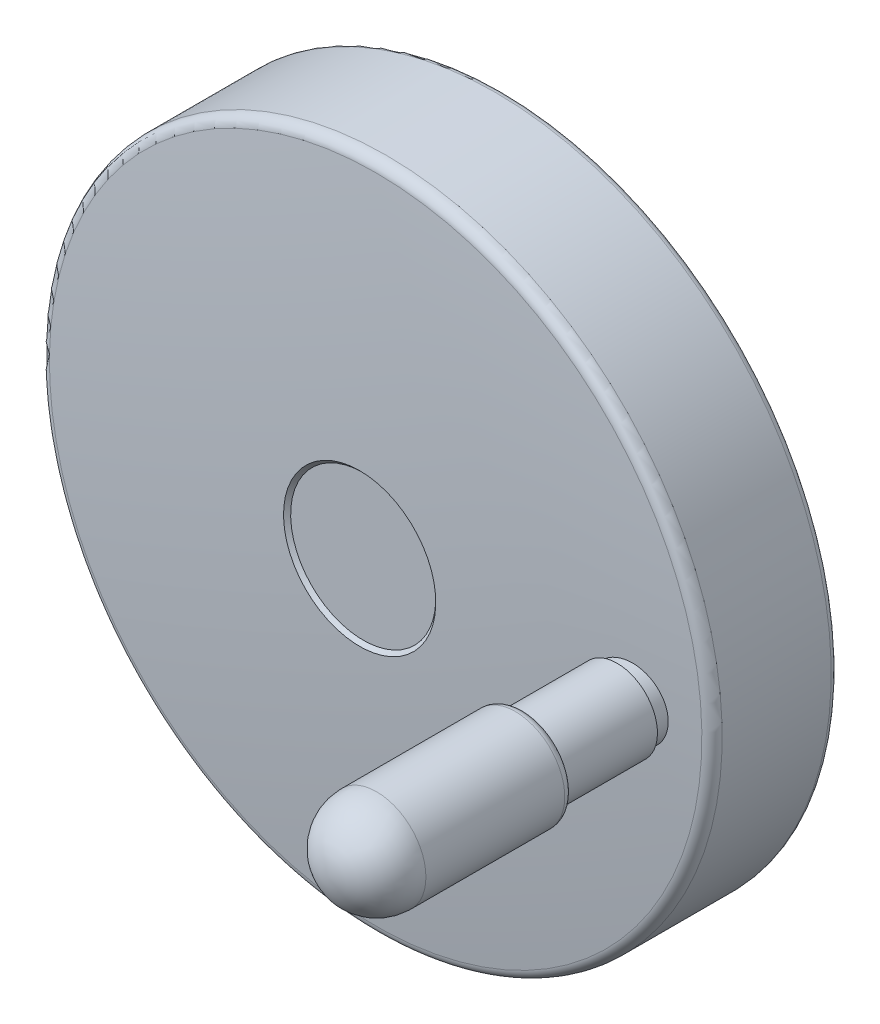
ISO-10303-21;
HEADER;
FILE_DESCRIPTION(('STEP AP214'),'2;1');
FILE_NAME('part.step','',(''),(''),'','','');
FILE_SCHEMA(('AUTOMOTIVE_DESIGN { 1 0 10303 214 1 1 1 1 }'));
ENDSEC;
DATA;
#1=APPLICATION_CONTEXT('core data for automotive mechanical design processes');
#2=APPLICATION_PROTOCOL_DEFINITION('international standard','automotive_design',2000,#1);
#3=PRODUCT_CONTEXT('',#1,'mechanical');
#4=PRODUCT('Part','Part','',(#3));
#5=PRODUCT_RELATED_PRODUCT_CATEGORY('part','',(#4));
#6=PRODUCT_DEFINITION_FORMATION('','',#4);
#7=PRODUCT_DEFINITION_CONTEXT('part definition',#1,'design');
#8=PRODUCT_DEFINITION('design','',#6,#7);
#9=PRODUCT_DEFINITION_SHAPE('','',#8);
#10=(LENGTH_UNIT() NAMED_UNIT(*) SI_UNIT(.MILLI.,.METRE.));
#11=(NAMED_UNIT(*) PLANE_ANGLE_UNIT() SI_UNIT($,.RADIAN.));
#12=(NAMED_UNIT(*) SI_UNIT($,.STERADIAN.) SOLID_ANGLE_UNIT());
#13=UNCERTAINTY_MEASURE_WITH_UNIT(LENGTH_MEASURE(1.E-05),#10,'distance_accuracy_value','');
#14=(GEOMETRIC_REPRESENTATION_CONTEXT(3) GLOBAL_UNCERTAINTY_ASSIGNED_CONTEXT((#13)) GLOBAL_UNIT_ASSIGNED_CONTEXT((#10,
#11,#12)) REPRESENTATION_CONTEXT('',''));
#15=CARTESIAN_POINT('',(0.,0.,0.));
#16=DIRECTION('',(0.,0.,1.));
#17=DIRECTION('',(1.,0.,0.));
#18=AXIS2_PLACEMENT_3D('',#15,#16,#17);
#19=CARTESIAN_POINT('',(0.,0.,44.));
#20=DIRECTION('',(0.,0.,1.));
#21=DIRECTION('',(0.,1.,0.));
#22=AXIS2_PLACEMENT_3D('',#19,#20,#21);
#23=PLANE('',#22);
#24=CARTESIAN_POINT('',(58.,0.,44.));
#25=DIRECTION('',(0.,0.,1.));
#26=DIRECTION('',(0.,1.,0.));
#27=AXIS2_PLACEMENT_3D('',#24,#25,#26);
#28=CIRCLE('',#27,6.75);
#29=CARTESIAN_POINT('',(58.,6.74999999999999,44.));
#30=VERTEX_POINT('',#29);
#31=EDGE_CURVE('E791',#30,#30,#28,.T.);
#32=ORIENTED_EDGE('',*,*,#31,.F.);
#33=EDGE_LOOP('',(#32));
#34=FACE_BOUND('',#33,.T.);
#35=CARTESIAN_POINT('',(58.,0.,44.));
#36=DIRECTION('',(0.,0.,-1.));
#37=DIRECTION('',(0.,-1.,0.));
#38=AXIS2_PLACEMENT_3D('',#35,#36,#37);
#39=CIRCLE('',#38,8.);
#40=CARTESIAN_POINT('',(58.,-8.,44.));
#41=VERTEX_POINT('',#40);
#42=EDGE_CURVE('E813',#41,#41,#39,.T.);
#43=ORIENTED_EDGE('',*,*,#42,.F.);
#44=EDGE_LOOP('',(#43));
#45=FACE_BOUND('',#44,.T.);
#46=ADVANCED_FACE('F16',(#34,#45),#23,.T.);
#47=CARTESIAN_POINT('',(58.,0.,40.));
#48=DIRECTION('',(0.,0.,-1.));
#49=DIRECTION('',(0.,-1.,0.));
#50=AXIS2_PLACEMENT_3D('',#47,#48,#49);
#51=CYLINDRICAL_SURFACE('',#50,8.);
#52=CARTESIAN_POINT('',(50.,0.,42.2250306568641));
#53=CARTESIAN_POINT('',(50.0000012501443,0.224049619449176,42.225030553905));
#54=CARTESIAN_POINT('',(50.0094201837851,0.448140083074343,42.224253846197));
#55=CARTESIAN_POINT('',(50.0470362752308,0.89477442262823,42.2211519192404));
#56=CARTESIAN_POINT('',(50.0752390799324,1.11731781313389,42.218826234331));
#57=CARTESIAN_POINT('',(50.1502824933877,1.55958907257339,42.2126378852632));
#58=CARTESIAN_POINT('',(50.1971527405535,1.77931188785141,42.2087727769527));
#59=CARTESIAN_POINT('',(50.3092356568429,2.21418276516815,42.1995298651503));
#60=CARTESIAN_POINT('',(50.3744630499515,2.42932700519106,42.1941508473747));
#61=CARTESIAN_POINT('',(50.5226371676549,2.85294696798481,42.1819313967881));
#62=CARTESIAN_POINT('',(50.605551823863,3.06143398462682,42.175093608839));
#63=CARTESIAN_POINT('',(50.7886124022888,3.47076023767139,42.1599967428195));
#64=CARTESIAN_POINT('',(50.8887660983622,3.67159597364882,42.1517370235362));
#65=CARTESIAN_POINT('',(51.1055625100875,4.06411141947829,42.1338573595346));
#66=CARTESIAN_POINT('',(51.2222061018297,4.25579064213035,42.124237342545));
#67=CARTESIAN_POINT('',(51.4710836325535,4.62854737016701,42.1037110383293));
#68=CARTESIAN_POINT('',(51.6033105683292,4.8096295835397,42.0928053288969));
#69=CARTESIAN_POINT('',(51.8827486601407,5.16038980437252,42.0697574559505));
#70=CARTESIAN_POINT('',(52.0299912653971,5.33004258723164,42.0576126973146));
#71=CARTESIAN_POINT('',(52.3380200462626,5.65616873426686,42.03220536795));
#72=CARTESIAN_POINT('',(52.4987930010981,5.81265467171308,42.0189438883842));
#73=CARTESIAN_POINT('',(52.8329365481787,6.11160654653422,41.9913809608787));
#74=CARTESIAN_POINT('',(53.0063129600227,6.25406593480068,41.9770790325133));
#75=CARTESIAN_POINT('',(53.3644059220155,6.52392080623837,41.9475387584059));
#76=CARTESIAN_POINT('',(53.5491251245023,6.65131274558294,41.9323001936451));
#77=CARTESIAN_POINT('',(53.929134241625,6.89047210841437,41.9009499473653));
#78=CARTESIAN_POINT('',(54.1244545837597,7.00219085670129,41.8848357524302));
#79=CARTESIAN_POINT('',(54.5237634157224,7.20876623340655,41.8518910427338));
#80=CARTESIAN_POINT('',(54.7277520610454,7.30362255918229,41.8350605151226));
#81=CARTESIAN_POINT('',(55.142945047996,7.47581065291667,41.8008028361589));
#82=CARTESIAN_POINT('',(55.3541493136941,7.55314260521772,41.7833756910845));
#83=CARTESIAN_POINT('',(55.782283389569,7.68974797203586,41.7480476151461));
#84=CARTESIAN_POINT('',(55.9992132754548,7.74902114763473,41.7301466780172));
#85=CARTESIAN_POINT('',(56.4378870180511,7.84923984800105,41.6939461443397));
#86=CARTESIAN_POINT('',(56.6596428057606,7.89013279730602,41.6756455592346));
#87=CARTESIAN_POINT('',(57.1058733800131,7.95307022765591,41.638818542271));
#88=CARTESIAN_POINT('',(57.3303490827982,7.97510816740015,41.6202920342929));
#89=CARTESIAN_POINT('',(57.7803133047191,8.00015641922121,41.5831539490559));
#90=CARTESIAN_POINT('',(58.0058016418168,8.00317002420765,41.5645423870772));
#91=CARTESIAN_POINT('',(58.4562366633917,7.99015735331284,41.5273624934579));
#92=CARTESIAN_POINT('',(58.6811833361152,7.97413066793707,41.5087941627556));
#93=CARTESIAN_POINT('',(59.1292693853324,7.923110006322,41.4718052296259));
#94=CARTESIAN_POINT('',(59.352405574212,7.88808784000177,41.453384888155));
#95=CARTESIAN_POINT('',(59.7949481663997,7.79930086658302,41.416850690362));
#96=CARTESIAN_POINT('',(60.0143544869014,7.74553564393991,41.3987368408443));
#97=CARTESIAN_POINT('',(60.4478697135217,7.61963780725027,41.3629451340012));
#98=CARTESIAN_POINT('',(60.6619786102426,7.54750516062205,41.3452672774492));
#99=CARTESIAN_POINT('',(61.0833701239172,7.38537694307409,41.3104739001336));
#100=CARTESIAN_POINT('',(61.2906527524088,7.29538140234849,41.2933583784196));
#101=CARTESIAN_POINT('',(61.6967855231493,7.09821809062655,41.2598224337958));
#102=CARTESIAN_POINT('',(61.8956407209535,6.9910608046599,41.2434015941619));
#103=CARTESIAN_POINT('',(62.283623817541,6.76028936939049,41.2113620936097));
#104=CARTESIAN_POINT('',(62.4727519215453,6.63667556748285,41.1957434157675));
#105=CARTESIAN_POINT('',(62.8399129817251,6.37386909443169,41.165421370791));
#106=CARTESIAN_POINT('',(63.0179467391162,6.23467755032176,41.1507179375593));
#107=CARTESIAN_POINT('',(63.3616466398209,5.94169470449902,41.1223316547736));
#108=CARTESIAN_POINT('',(63.5273130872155,5.78790376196,41.1086487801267));
#109=CARTESIAN_POINT('',(63.8446782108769,5.46722014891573,41.0824359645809));
#110=CARTESIAN_POINT('',(63.9964115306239,5.30036199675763,41.0699031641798));
#111=CARTESIAN_POINT('',(64.2852404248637,4.95444298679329,41.04604602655));
#112=CARTESIAN_POINT('',(64.4223411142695,4.77538642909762,41.034721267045));
#113=CARTESIAN_POINT('',(64.6810574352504,4.40616825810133,41.0133503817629));
#114=CARTESIAN_POINT('',(64.8026629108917,4.21599947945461,41.0033050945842));
#115=CARTESIAN_POINT('',(65.0293960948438,3.82602412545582,40.9845753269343));
#116=CARTESIAN_POINT('',(65.134524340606,3.62621786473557,40.9758908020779));
#117=CARTESIAN_POINT('',(65.3273035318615,3.21889242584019,40.9599652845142));
#118=CARTESIAN_POINT('',(65.4149968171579,3.01139342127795,40.9527207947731));
#119=CARTESIAN_POINT('',(65.5725884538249,2.58970359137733,40.9397017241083));
#120=CARTESIAN_POINT('',(65.6424872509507,2.37551293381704,40.9339271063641));
#121=CARTESIAN_POINT('',(65.7638667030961,1.94238678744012,40.9238993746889));
#122=CARTESIAN_POINT('',(65.8153821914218,1.72346111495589,40.9196433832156));
#123=CARTESIAN_POINT('',(65.8997862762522,1.28211371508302,40.9126702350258));
#124=CARTESIAN_POINT('',(65.9326840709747,1.05969376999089,40.9099523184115));
#125=CARTESIAN_POINT('',(65.970765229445,0.697435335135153,40.9068061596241));
#126=CARTESIAN_POINT('',(65.9817247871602,0.55818267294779,40.9059007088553));
#127=CARTESIAN_POINT('',(65.9963425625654,0.27929196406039,40.9046930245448));
#128=CARTESIAN_POINT('',(66.000000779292,0.139653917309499,40.9043907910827));
#129=CARTESIAN_POINT('',(65.9999987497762,-0.224047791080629,40.9043909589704));
#130=CARTESIAN_POINT('',(65.9905799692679,-0.44813642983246,40.9051691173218));
#131=CARTESIAN_POINT('',(65.952964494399,-0.894767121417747,40.9082768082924));
#132=CARTESIAN_POINT('',(65.9247621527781,-1.1173086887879,40.9106068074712));
#133=CARTESIAN_POINT('',(65.8497199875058,-1.5595763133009,40.9168065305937));
#134=CARTESIAN_POINT('',(65.802850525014,-1.77929731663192,40.9206787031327));
#135=CARTESIAN_POINT('',(65.6907695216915,-2.21416457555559,40.9299382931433));
#136=CARTESIAN_POINT('',(65.6255432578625,-2.42930700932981,40.9353269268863));
#137=CARTESIAN_POINT('',(65.4773717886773,-2.85292332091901,40.9475678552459));
#138=CARTESIAN_POINT('',(65.3944586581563,-3.06140849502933,40.9544175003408));
#139=CARTESIAN_POINT('',(65.211401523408,-3.47073115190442,40.9695400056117));
#140=CARTESIAN_POINT('',(65.1112497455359,-3.67156513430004,40.9778135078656));
#141=CARTESIAN_POINT('',(64.8944575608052,-4.06407723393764,40.9957222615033));
#142=CARTESIAN_POINT('',(64.7778162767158,-4.25575486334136,41.0053575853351));
#143=CARTESIAN_POINT('',(64.5289437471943,-4.62850862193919,41.0259155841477));
#144=CARTESIAN_POINT('',(64.3967195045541,-4.80958945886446,41.0368376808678));
#145=CARTESIAN_POINT('',(64.1172861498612,-5.16034849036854,41.0599190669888));
#146=CARTESIAN_POINT('',(63.970045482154,-5.33000137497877,41.0720809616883));
#147=CARTESIAN_POINT('',(63.6620207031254,-5.65612789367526,41.0975226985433));
#148=CARTESIAN_POINT('',(63.501249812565,-5.8126141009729,41.1108014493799));
#149=CARTESIAN_POINT('',(63.1671104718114,-6.11156674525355,41.138398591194));
#150=CARTESIAN_POINT('',(62.9937362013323,-6.25402663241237,41.1527174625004));
#151=CARTESIAN_POINT('',(62.6356475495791,-6.52388276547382,41.1822908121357));
#152=CARTESIAN_POINT('',(62.4509305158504,-6.65127546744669,41.1975455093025));
#153=CARTESIAN_POINT('',(62.0709236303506,-6.89043795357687,41.2289269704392));
#154=CARTESIAN_POINT('',(61.875603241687,-7.00215888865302,41.2450562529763));
#155=CARTESIAN_POINT('',(61.4762940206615,-7.20873857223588,41.2780294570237));
#156=CARTESIAN_POINT('',(61.2723050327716,-7.30359701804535,41.2948733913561));
#157=CARTESIAN_POINT('',(60.8571110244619,-7.47578926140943,41.3291558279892));
#158=CARTESIAN_POINT('',(60.64590607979,-7.5531232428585,41.3465943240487));
#159=CARTESIAN_POINT('',(60.2177702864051,-7.68973253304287,41.3819427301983));
#160=CARTESIAN_POINT('',(60.0008393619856,-7.74900760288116,41.3998526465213));
#161=CARTESIAN_POINT('',(59.56216277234,-7.84922999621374,41.4360685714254));
#162=CARTESIAN_POINT('',(59.3404051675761,-7.89012471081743,41.4543755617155));
#163=CARTESIAN_POINT('',(58.8941705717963,-7.95306534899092,41.4912125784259));
#164=CARTESIAN_POINT('',(58.6696926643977,-7.97510473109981,41.5097426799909));
#165=CARTESIAN_POINT('',(58.2197236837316,-8.00015547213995,41.5468850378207));
#166=CARTESIAN_POINT('',(57.9942327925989,-8.00317012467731,41.565497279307));
#167=CARTESIAN_POINT('',(57.5437923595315,-7.99015908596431,41.6026756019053));
#168=CARTESIAN_POINT('',(57.3188428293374,-7.97413298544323,41.6212416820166));
#169=CARTESIAN_POINT('',(56.8707528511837,-7.92311320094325,41.6582230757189));
#170=CARTESIAN_POINT('',(56.647615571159,-7.88809149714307,41.6766381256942));
#171=CARTESIAN_POINT('',(56.2050705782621,-7.79930521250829,41.7131590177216));
#172=CARTESIAN_POINT('',(55.9856629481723,-7.74554021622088,41.7312648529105));
#173=CARTESIAN_POINT('',(55.5521449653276,-7.61964256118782,41.7670380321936));
#174=CARTESIAN_POINT('',(55.3380346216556,-7.54750987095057,41.7847053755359));
#175=CARTESIAN_POINT('',(54.9166401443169,-7.38538127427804,41.8194755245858));
#176=CARTESIAN_POINT('',(54.7093559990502,-7.29538539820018,41.8365783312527));
#177=CARTESIAN_POINT('',(54.3032225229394,-7.09822224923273,41.8700868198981));
#178=CARTESIAN_POINT('',(54.1043680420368,-6.99106565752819,41.8864929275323));
#179=CARTESIAN_POINT('',(53.7163862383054,-6.76029570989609,41.9185015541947));
#180=CARTESIAN_POINT('',(53.5272587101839,-6.63668270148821,41.9341040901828));
#181=CARTESIAN_POINT('',(53.1600986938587,-6.37387792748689,41.9643928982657));
#182=CARTESIAN_POINT('',(52.9820654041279,-6.23468728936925,41.9790792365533));
#183=CARTESIAN_POINT('',(52.6383663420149,-5.94170638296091,42.007430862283));
#184=CARTESIAN_POINT('',(52.4727002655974,-5.78791647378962,42.0210961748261));
#185=CARTESIAN_POINT('',(52.1553362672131,-5.46723555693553,42.0472739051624));
#186=CARTESIAN_POINT('',(52.0036036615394,-5.30037910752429,42.0597891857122));
#187=CARTESIAN_POINT('',(51.7147760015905,-4.95446374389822,42.0836118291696));
#188=CARTESIAN_POINT('',(51.57767583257,-4.77540912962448,42.0949196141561));
#189=CARTESIAN_POINT('',(51.3189603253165,-4.4061950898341,42.1162575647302));
#190=CARTESIAN_POINT('',(51.197355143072,-4.21602849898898,42.1262868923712));
#191=CARTESIAN_POINT('',(50.9706222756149,-3.82605775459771,42.1449862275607));
#192=CARTESIAN_POINT('',(50.8654940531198,-3.62625391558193,42.1536562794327));
#193=CARTESIAN_POINT('',(50.6727137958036,-3.21893184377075,42.1695548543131));
#194=CARTESIAN_POINT('',(50.5850195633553,-3.01143371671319,42.1767868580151));
#195=CARTESIAN_POINT('',(50.4274259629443,-2.58974570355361,42.1897831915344));
#196=CARTESIAN_POINT('',(50.3575261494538,-2.37555598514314,42.1955475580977));
#197=CARTESIAN_POINT('',(50.2361445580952,-1.94243172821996,42.2055573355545));
#198=CARTESIAN_POINT('',(50.1846279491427,-1.72350700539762,42.2098056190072));
#199=CARTESIAN_POINT('',(50.1002214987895,-1.28216149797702,42.2167661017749));
#200=CARTESIAN_POINT('',(50.0673224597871,-1.05974249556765,42.219479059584));
#201=CARTESIAN_POINT('',(50.029238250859,-0.69747677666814,42.2226195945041));
#202=CARTESIAN_POINT('',(50.0182773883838,-0.558215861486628,42.2235234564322));
#203=CARTESIAN_POINT('',(50.0036578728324,-0.279308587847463,42.2247290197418));
#204=CARTESIAN_POINT('',(49.9999992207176,-0.139662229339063,42.2250307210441));
#205=CARTESIAN_POINT('',(50.,0.,42.2250306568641));
#206=B_SPLINE_CURVE_WITH_KNOTS('',3,(#52,#53,#54,#55,#56,#57,#58,#59,#60,#61,#62,#63,#64,#65,
#66,#67,#68,#69,#70,#71,#72,#73,#74,#75,#76,#77,#78,#79,#80,#81,#82,#83,#84,#85,#86,#87,#88,#89,
#90,#91,#92,#93,#94,#95,#96,#97,#98,#99,#100,#101,#102,#103,#104,#105,#106,#107,#108,#109,#110,
#111,#112,#113,#114,#115,#116,#117,#118,#119,#120,#121,#122,#123,#124,#125,#126,#127,#128,#129,
#130,#131,#132,#133,#134,#135,#136,#137,#138,#139,#140,#141,#142,#143,#144,#145,#146,#147,#148,
#149,#150,#151,#152,#153,#154,#155,#156,#157,#158,#159,#160,#161,#162,#163,#164,#165,#166,#167,
#168,#169,#170,#171,#172,#173,#174,#175,#176,#177,#178,#179,#180,#181,#182,#183,#184,#185,#186,
#187,#188,#189,#190,#191,#192,#193,#194,#195,#196,#197,#198,#199,#200,#201,#202,#203,#204,#205),
.UNSPECIFIED.,.T.,.F.,(4,2,2,2,2,2,2,2,2,2,2,2,2,2,2,2,2,2,2,2,2,2,2,2,2,2,2,2,2,2,2,2,2,2,2,2,
2,2,2,2,2,2,2,2,2,2,2,2,2,2,2,2,2,2,2,2,2,2,2,2,2,2,2,2,2,2,2,2,2,2,2,2,2,2,2,2,4),(0.,
0.672020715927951,1.34424354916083,2.01753795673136,2.69137395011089,3.36399845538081,
4.03692707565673,4.70989146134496,5.38255455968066,6.05665662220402,6.73010748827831,
7.40387131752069,8.07779330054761,8.75376398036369,9.42974679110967,10.105722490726,
10.7817071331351,11.4596132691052,12.137754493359,12.8157783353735,13.4938167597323,
14.1728641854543,14.8519266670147,15.5309903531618,16.2100528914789,16.8887021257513,
17.5673370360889,18.2459228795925,18.9244920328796,19.6013255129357,20.2779216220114,
20.9549589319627,21.6319741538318,22.3073246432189,22.9826582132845,23.6567052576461,
24.3304189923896,24.7493008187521,25.1681827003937,25.8401979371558,26.5124153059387,
27.1857042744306,27.8595347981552,28.5321535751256,29.2050764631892,29.8780351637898,
30.5506925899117,31.2247938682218,31.8982439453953,32.5720070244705,33.2459282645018,
33.9219055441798,34.5978949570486,35.2738772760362,35.949868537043,36.6277825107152,
37.3059315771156,37.9839632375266,38.6620094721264,39.3410586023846,40.0201227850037,
40.6991881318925,41.3782523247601,42.0568954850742,42.7355243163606,43.4141040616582,
44.0926671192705,44.7694924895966,45.4460804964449,46.1231097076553,46.8001168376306,
47.4754648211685,48.1507958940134,48.8248405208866,49.4985518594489,49.9174586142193,
50.3363654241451),.UNSPECIFIED.);
#207=CARTESIAN_POINT('',(50.,0.,42.2250306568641));
#208=VERTEX_POINT('',#207);
#209=EDGE_CURVE('E795',#208,#208,#206,.T.);
#210=ORIENTED_EDGE('',*,*,#209,.F.);
#211=EDGE_LOOP('',(#210));
#212=FACE_BOUND('',#211,.T.);
#213=ORIENTED_EDGE('',*,*,#42,.T.);
#214=EDGE_LOOP('',(#213));
#215=FACE_BOUND('',#214,.T.);
#216=ADVANCED_FACE('F636',(#212,#215),#51,.T.);
#217=CARTESIAN_POINT('',(0.,0.,-661.12500000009));
#218=DIRECTION('',(-1.,0.,0.));
#219=DIRECTION('',(0.,0.,1.));
#220=AXIS2_PLACEMENT_3D('',#217,#218,#219);
#221=SPHERICAL_SURFACE('',#220,705.125000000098);
#222=CARTESIAN_POINT('',(0.,0.,40.2268674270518));
#223=DIRECTION('',(0.,0.,1.));
#224=DIRECTION('',(0.,1.,0.));
#225=AXIS2_PLACEMENT_3D('',#222,#223,#224);
#226=CIRCLE('',#225,72.8479490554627);
#227=CARTESIAN_POINT('',(0.,72.8479490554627,40.2268674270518));
#228=VERTEX_POINT('',#227);
#229=EDGE_CURVE('E788',#228,#228,#226,.T.);
#230=ORIENTED_EDGE('',*,*,#229,.T.);
#231=EDGE_LOOP('',(#230));
#232=FACE_BOUND('',#231,.T.);
#233=CARTESIAN_POINT('',(0.,0.,43.7950420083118));
#234=DIRECTION('',(0.,0.,1.));
#235=DIRECTION('',(0.,1.,0.));
#236=AXIS2_PLACEMENT_3D('',#233,#234,#235);
#237=CIRCLE('',#236,17.);
#238=CARTESIAN_POINT('',(0.,17.,43.7950420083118));
#239=VERTEX_POINT('',#238);
#240=EDGE_CURVE('E792',#239,#239,#237,.F.);
#241=ORIENTED_EDGE('',*,*,#240,.T.);
#242=EDGE_LOOP('',(#241));
#243=FACE_BOUND('',#242,.T.);
#244=ORIENTED_EDGE('',*,*,#209,.T.);
#245=EDGE_LOOP('',(#244));
#246=FACE_BOUND('',#245,.T.);
#247=ADVANCED_FACE('F627',(#232,#243,#246),#221,.T.);
#248=CARTESIAN_POINT('',(0.,0.,37.8397098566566));
#249=DIRECTION('',(0.,0.,1.));
#250=DIRECTION('',(0.,1.,0.));
#251=AXIS2_PLACEMENT_3D('',#248,#249,#250);
#252=TOROIDAL_SURFACE('',#251,72.6,2.39999999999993);
#253=CARTESIAN_POINT('',(0.,0.,37.8397098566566));
#254=DIRECTION('',(0.,0.,1.));
#255=DIRECTION('',(0.,1.,0.));
#256=AXIS2_PLACEMENT_3D('',#253,#254,#255);
#257=CIRCLE('',#256,75.);
#258=CARTESIAN_POINT('',(0.,75.,37.8397098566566));
#259=VERTEX_POINT('',#258);
#260=EDGE_CURVE('E801',#259,#259,#257,.T.);
#261=ORIENTED_EDGE('',*,*,#260,.T.);
#262=EDGE_LOOP('',(#261));
#263=FACE_BOUND('',#262,.T.);
#264=ORIENTED_EDGE('',*,*,#229,.F.);
#265=EDGE_LOOP('',(#264));
#266=FACE_BOUND('',#265,.T.);
#267=ADVANCED_FACE('F618',(#263,#266),#252,.T.);
#268=CARTESIAN_POINT('',(0.,0.,43.7950420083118));
#269=DIRECTION('',(0.,0.,1.));
#270=DIRECTION('',(0.,1.,0.));
#271=AXIS2_PLACEMENT_3D('',#268,#269,#270);
#272=CONICAL_SURFACE('',#271,17.,0.785398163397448);
#273=CARTESIAN_POINT('',(0.,0.,43.));
#274=DIRECTION('',(0.,0.,1.));
#275=DIRECTION('',(0.,1.,0.));
#276=AXIS2_PLACEMENT_3D('',#273,#274,#275);
#277=CIRCLE('',#276,16.2049579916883);
#278=CARTESIAN_POINT('',(0.,16.2049579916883,43.));
#279=VERTEX_POINT('',#278);
#280=EDGE_CURVE('E802',#279,#279,#277,.T.);
#281=ORIENTED_EDGE('',*,*,#280,.F.);
#282=EDGE_LOOP('',(#281));
#283=FACE_BOUND('',#282,.T.);
#284=ORIENTED_EDGE('',*,*,#240,.F.);
#285=EDGE_LOOP('',(#284));
#286=FACE_BOUND('',#285,.T.);
#287=ADVANCED_FACE('F609',(#283,#286),#272,.F.);
#288=CARTESIAN_POINT('',(0.,0.,25.6698549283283));
#289=DIRECTION('',(0.,0.,-1.));
#290=DIRECTION('',(0.,-1.,0.));
#291=AXIS2_PLACEMENT_3D('',#288,#289,#290);
#292=CYLINDRICAL_SURFACE('',#291,75.);
#293=CARTESIAN_POINT('',(0.,0.,13.5));
#294=DIRECTION('',(0.,0.,-1.));
#295=DIRECTION('',(0.,-1.,0.));
#296=AXIS2_PLACEMENT_3D('',#293,#294,#295);
#297=CIRCLE('',#296,75.);
#298=CARTESIAN_POINT('',(0.,-75.,13.5));
#299=VERTEX_POINT('',#298);
#300=EDGE_CURVE('E699',#299,#299,#297,.F.);
#301=ORIENTED_EDGE('',*,*,#300,.T.);
#302=EDGE_LOOP('',(#301));
#303=FACE_BOUND('',#302,.T.);
#304=ORIENTED_EDGE('',*,*,#260,.F.);
#305=EDGE_LOOP('',(#304));
#306=FACE_BOUND('',#305,.T.);
#307=ADVANCED_FACE('F600',(#303,#306),#292,.T.);
#308=CARTESIAN_POINT('',(-8.10247899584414,0.,43.));
#309=DIRECTION('',(0.,0.,1.));
#310=DIRECTION('',(0.,1.,0.));
#311=AXIS2_PLACEMENT_3D('',#308,#309,#310);
#312=PLANE('',#311);
#313=ORIENTED_EDGE('',*,*,#280,.T.);
#314=EDGE_LOOP('',(#313));
#315=FACE_BOUND('',#314,.T.);
#316=ADVANCED_FACE('F591',(#315),#312,.T.);
#317=CARTESIAN_POINT('',(0.,0.,13.5));
#318=DIRECTION('',(0.,0.,1.));
#319=DIRECTION('',(0.,1.,0.));
#320=AXIS2_PLACEMENT_3D('',#317,#318,#319);
#321=TOROIDAL_SURFACE('',#320,73.5,1.5);
#322=ORIENTED_EDGE('',*,*,#300,.F.);
#323=EDGE_LOOP('',(#322));
#324=FACE_BOUND('',#323,.T.);
#325=CARTESIAN_POINT('',(0.,0.,12.));
#326=DIRECTION('',(0.,0.,1.));
#327=DIRECTION('',(0.,-1.,0.));
#328=AXIS2_PLACEMENT_3D('',#325,#326,#327);
#329=CIRCLE('',#328,73.5);
#330=CARTESIAN_POINT('',(0.,-73.5,12.));
#331=VERTEX_POINT('',#330);
#332=CARTESIAN_POINT('',(0.,73.5,12.));
#333=VERTEX_POINT('',#332);
#334=EDGE_CURVE('E724',#331,#333,#329,.T.);
#335=ORIENTED_EDGE('',*,*,#334,.T.);
#336=CARTESIAN_POINT('',(0.,0.,12.));
#337=DIRECTION('',(0.,0.,1.));
#338=DIRECTION('',(0.,1.,0.));
#339=AXIS2_PLACEMENT_3D('',#336,#337,#338);
#340=CIRCLE('',#339,73.5);
#341=CARTESIAN_POINT('',(-73.5,0.,12.));
#342=VERTEX_POINT('',#341);
#343=EDGE_CURVE('E744',#333,#342,#340,.T.);
#344=ORIENTED_EDGE('',*,*,#343,.T.);
#345=CARTESIAN_POINT('',(0.,0.,12.));
#346=DIRECTION('',(0.,0.,1.));
#347=DIRECTION('',(-1.,0.,0.));
#348=AXIS2_PLACEMENT_3D('',#345,#346,#347);
#349=CIRCLE('',#348,73.5);
#350=EDGE_CURVE('E36',#342,#331,#349,.T.);
#351=ORIENTED_EDGE('',*,*,#350,.T.);
#352=EDGE_LOOP('',(#335,#344,#351));
#353=FACE_BOUND('',#352,.T.);
#354=ADVANCED_FACE('F582',(#324,#353),#321,.T.);
#355=CARTESIAN_POINT('',(-72.75,0.,12.));
#356=DIRECTION('',(0.,0.,-1.));
#357=DIRECTION('',(-1.,0.,0.));
#358=AXIS2_PLACEMENT_3D('',#355,#356,#357);
#359=PLANE('',#358);
#360=CARTESIAN_POINT('',(0.,0.,12.));
#361=DIRECTION('',(0.,0.,-1.));
#362=DIRECTION('',(0.,-1.,0.));
#363=AXIS2_PLACEMENT_3D('',#360,#361,#362);
#364=CIRCLE('',#363,72.);
#365=CARTESIAN_POINT('',(0.,-72.,12.));
#366=VERTEX_POINT('',#365);
#367=EDGE_CURVE('E745',#366,#366,#364,.F.);
#368=ORIENTED_EDGE('',*,*,#367,.T.);
#369=EDGE_LOOP('',(#368));
#370=FACE_BOUND('',#369,.T.);
#371=ORIENTED_EDGE('',*,*,#343,.F.);
#372=ORIENTED_EDGE('',*,*,#334,.F.);
#373=ORIENTED_EDGE('',*,*,#350,.F.);
#374=EDGE_LOOP('',(#371,#372,#373));
#375=FACE_BOUND('',#374,.T.);
#376=ADVANCED_FACE('F574',(#370,#375),#359,.T.);
#377=CARTESIAN_POINT('',(0.,0.,14.8));
#378=DIRECTION('',(0.,0.,-1.));
#379=DIRECTION('',(0.,-1.,0.));
#380=AXIS2_PLACEMENT_3D('',#377,#378,#379);
#381=CYLINDRICAL_SURFACE('',#380,72.);
#382=ORIENTED_EDGE('',*,*,#367,.F.);
#383=EDGE_LOOP('',(#382));
#384=FACE_BOUND('',#383,.T.);
#385=CARTESIAN_POINT('',(0.,0.,17.6));
#386=DIRECTION('',(0.,0.,-1.));
#387=DIRECTION('',(0.,-1.,0.));
#388=AXIS2_PLACEMENT_3D('',#385,#386,#387);
#389=CIRCLE('',#388,72.);
#390=CARTESIAN_POINT('',(0.,-72.,17.6));
#391=VERTEX_POINT('',#390);
#392=EDGE_CURVE('E749',#391,#391,#389,.T.);
#393=ORIENTED_EDGE('',*,*,#392,.F.);
#394=EDGE_LOOP('',(#393));
#395=FACE_BOUND('',#394,.T.);
#396=ADVANCED_FACE('F565',(#384,#395),#381,.F.);
#397=CARTESIAN_POINT('',(58.,0.,33.));
#398=DIRECTION('',(0.,0.,1.));
#399=DIRECTION('',(0.,1.,0.));
#400=AXIS2_PLACEMENT_3D('',#397,#398,#399);
#401=CYLINDRICAL_SURFACE('',#400,3.3235);
#402=CARTESIAN_POINT('',(58.,0.,29.0904999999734));
#403=DIRECTION('',(0.,0.,1.));
#404=DIRECTION('',(0.,1.,0.));
#405=AXIS2_PLACEMENT_3D('',#402,#403,#404);
#406=CIRCLE('',#405,3.3235);
#407=CARTESIAN_POINT('',(58.,3.32349999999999,29.0904999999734));
#408=VERTEX_POINT('',#407);
#409=EDGE_CURVE('E9',#408,#408,#406,.T.);
#410=ORIENTED_EDGE('',*,*,#409,.T.);
#411=EDGE_LOOP('',(#410));
#412=FACE_BOUND('',#411,.T.);
#413=CARTESIAN_POINT('',(58.,0.,22.6765));
#414=DIRECTION('',(0.,0.,1.));
#415=DIRECTION('',(0.,1.,0.));
#416=AXIS2_PLACEMENT_3D('',#413,#414,#415);
#417=CIRCLE('',#416,3.3235);
#418=CARTESIAN_POINT('',(58.,3.3235,22.6765));
#419=VERTEX_POINT('',#418);
#420=EDGE_CURVE('E746',#419,#419,#417,.T.);
#421=ORIENTED_EDGE('',*,*,#420,.F.);
#422=EDGE_LOOP('',(#421));
#423=FACE_BOUND('',#422,.T.);
#424=ADVANCED_FACE('F555',(#412,#423),#401,.F.);
#425=CARTESIAN_POINT('',(58.,0.,22.0000000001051));
#426=DIRECTION('',(0.,0.,-1.));
#427=DIRECTION('',(0.,-1.,0.));
#428=AXIS2_PLACEMENT_3D('',#425,#426,#427);
#429=CONICAL_SURFACE('',#428,3.99999999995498,0.785398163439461);
#430=ORIENTED_EDGE('',*,*,#420,.T.);
#431=EDGE_LOOP('',(#430));
#432=FACE_BOUND('',#431,.T.);
#433=CARTESIAN_POINT('',(58.,0.,22.0000000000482));
#434=DIRECTION('',(0.,0.,-1.));
#435=DIRECTION('',(0.,-1.,0.));
#436=AXIS2_PLACEMENT_3D('',#433,#434,#435);
#437=CIRCLE('',#436,4.00000000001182);
#438=CARTESIAN_POINT('',(58.,-4.00000000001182,22.0000000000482));
#439=VERTEX_POINT('',#438);
#440=EDGE_CURVE('E752',#439,#439,#437,.F.);
#441=ORIENTED_EDGE('',*,*,#440,.F.);
#442=EDGE_LOOP('',(#441));
#443=FACE_BOUND('',#442,.T.);
#444=ADVANCED_FACE('F547',(#432,#443),#429,.F.);
#445=CARTESIAN_POINT('',(62.4,0.,22.));
#446=DIRECTION('',(0.,0.,1.));
#447=DIRECTION('',(0.,1.,0.));
#448=AXIS2_PLACEMENT_3D('',#445,#446,#447);
#449=PLANE('',#448);
#450=ORIENTED_EDGE('',*,*,#440,.T.);
#451=EDGE_LOOP('',(#450));
#452=FACE_BOUND('',#451,.T.);
#453=CARTESIAN_POINT('',(58.,0.,22.));
#454=DIRECTION('',(0.,0.,1.));
#455=DIRECTION('',(0.,1.,0.));
#456=AXIS2_PLACEMENT_3D('',#453,#454,#455);
#457=CIRCLE('',#456,4.8);
#458=CARTESIAN_POINT('',(58.,4.8,22.));
#459=VERTEX_POINT('',#458);
#460=EDGE_CURVE('E756',#459,#459,#457,.T.);
#461=ORIENTED_EDGE('',*,*,#460,.F.);
#462=EDGE_LOOP('',(#461));
#463=FACE_BOUND('',#462,.T.);
#464=ADVANCED_FACE('F539',(#452,#463),#449,.F.);
#465=CARTESIAN_POINT('',(58.,0.,11.));
#466=DIRECTION('',(0.,0.,1.));
#467=DIRECTION('',(0.,1.,0.));
#468=AXIS2_PLACEMENT_3D('',#465,#466,#467);
#469=CYLINDRICAL_SURFACE('',#468,4.8);
#470=CARTESIAN_POINT('',(58.,0.,17.6));
#471=DIRECTION('',(0.,0.,1.));
#472=DIRECTION('',(0.,1.,0.));
#473=AXIS2_PLACEMENT_3D('',#470,#471,#472);
#474=CIRCLE('',#473,4.8);
#475=CARTESIAN_POINT('',(58.,4.8,17.6));
#476=VERTEX_POINT('',#475);
#477=EDGE_CURVE('E760',#476,#476,#474,.T.);
#478=ORIENTED_EDGE('',*,*,#477,.F.);
#479=EDGE_LOOP('',(#478));
#480=FACE_BOUND('',#479,.T.);
#481=ORIENTED_EDGE('',*,*,#460,.T.);
#482=EDGE_LOOP('',(#481));
#483=FACE_BOUND('',#482,.T.);
#484=ADVANCED_FACE('F530',(#480,#483),#469,.F.);
#485=CARTESIAN_POINT('',(-60.2933835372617,0.,17.6));
#486=DIRECTION('',(0.,0.,-1.));
#487=DIRECTION('',(0.,-1.,0.));
#488=AXIS2_PLACEMENT_3D('',#485,#486,#487);
#489=PLANE('',#488);
#490=CARTESIAN_POINT('',(0.,0.,17.6));
#491=DIRECTION('',(0.,0.,-1.));
#492=DIRECTION('',(0.,-1.,0.));
#493=AXIS2_PLACEMENT_3D('',#490,#491,#492);
#494=CIRCLE('',#493,52.);
#495=CARTESIAN_POINT('',(0.,-52.,17.6));
#496=VERTEX_POINT('',#495);
#497=EDGE_CURVE('E764',#496,#496,#494,.F.);
#498=ORIENTED_EDGE('',*,*,#497,.T.);
#499=EDGE_LOOP('',(#498));
#500=FACE_BOUND('',#499,.T.);
#501=CARTESIAN_POINT('',(0.,0.,17.6));
#502=DIRECTION('',(0.,0.,1.));
#503=DIRECTION('',(0.,1.,0.));
#504=AXIS2_PLACEMENT_3D('',#501,#502,#503);
#505=CIRCLE('',#504,68.5867670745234);
#506=CARTESIAN_POINT('',(0.,68.5867670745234,17.6));
#507=VERTEX_POINT('',#506);
#508=EDGE_CURVE('E831',#507,#507,#505,.T.);
#509=ORIENTED_EDGE('',*,*,#508,.F.);
#510=EDGE_LOOP('',(#509));
#511=FACE_BOUND('',#510,.T.);
#512=ORIENTED_EDGE('',*,*,#477,.T.);
#513=EDGE_LOOP('',(#512));
#514=FACE_BOUND('',#513,.T.);
#515=ADVANCED_FACE('F521',(#500,#511,#514),#489,.T.);
#516=CARTESIAN_POINT('',(0.,0.,17.6));
#517=DIRECTION('',(0.,0.,-1.));
#518=DIRECTION('',(0.,-1.,0.));
#519=AXIS2_PLACEMENT_3D('',#516,#517,#518);
#520=CONICAL_SURFACE('',#519,52.,0.785398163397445);
#521=ORIENTED_EDGE('',*,*,#497,.F.);
#522=EDGE_LOOP('',(#521));
#523=FACE_BOUND('',#522,.T.);
#524=CARTESIAN_POINT('',(0.,0.,18.6));
#525=DIRECTION('',(0.,0.,-1.));
#526=DIRECTION('',(-1.,0.,0.));
#527=AXIS2_PLACEMENT_3D('',#524,#525,#526);
#528=CIRCLE('',#527,51.);
#529=CARTESIAN_POINT('',(-51.,0.,18.6));
#530=VERTEX_POINT('',#529);
#531=EDGE_CURVE('E761',#530,#530,#528,.T.);
#532=ORIENTED_EDGE('',*,*,#531,.F.);
#533=EDGE_LOOP('',(#532));
#534=FACE_BOUND('',#533,.T.);
#535=ADVANCED_FACE('F512',(#523,#534),#520,.F.);
#536=CARTESIAN_POINT('',(0.,0.,30.895813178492));
#537=DIRECTION('',(0.,0.,1.));
#538=DIRECTION('',(0.,1.,0.));
#539=AXIS2_PLACEMENT_3D('',#536,#537,#538);
#540=CONICAL_SURFACE('',#539,69.75,0.0872664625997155);
#541=CARTESIAN_POINT('',(0.,0.,30.895813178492));
#542=DIRECTION('',(0.,0.,-1.));
#543=DIRECTION('',(-1.,0.,0.));
#544=AXIS2_PLACEMENT_3D('',#541,#542,#543);
#545=CIRCLE('',#544,69.75);
#546=CARTESIAN_POINT('',(-69.75,0.,30.895813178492));
#547=VERTEX_POINT('',#546);
#548=EDGE_CURVE('E757',#547,#547,#545,.T.);
#549=ORIENTED_EDGE('',*,*,#548,.T.);
#550=EDGE_LOOP('',(#549));
#551=FACE_BOUND('',#550,.T.);
#552=ORIENTED_EDGE('',*,*,#508,.T.);
#553=EDGE_LOOP('',(#552));
#554=FACE_BOUND('',#553,.T.);
#555=ADVANCED_FACE('F504',(#551,#554),#540,.T.);
#556=CARTESIAN_POINT('',(0.,0.,24.6082464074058));
#557=DIRECTION('',(0.,0.,-1.));
#558=DIRECTION('',(0.,-1.,0.));
#559=AXIS2_PLACEMENT_3D('',#556,#557,#558);
#560=CYLINDRICAL_SURFACE('',#559,51.);
#561=ORIENTED_EDGE('',*,*,#531,.T.);
#562=EDGE_LOOP('',(#561));
#563=FACE_BOUND('',#562,.T.);
#564=CARTESIAN_POINT('',(0.,0.,30.6164928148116));
#565=DIRECTION('',(0.,0.,-1.));
#566=DIRECTION('',(0.,-1.,0.));
#567=AXIS2_PLACEMENT_3D('',#564,#565,#566);
#568=CIRCLE('',#567,51.);
#569=CARTESIAN_POINT('',(0.,-51.,30.6164928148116));
#570=VERTEX_POINT('',#569);
#571=EDGE_CURVE('E765',#570,#570,#568,.T.);
#572=ORIENTED_EDGE('',*,*,#571,.F.);
#573=EDGE_LOOP('',(#572));
#574=FACE_BOUND('',#573,.T.);
#575=ADVANCED_FACE('F495',(#563,#574),#560,.F.);
#576=CARTESIAN_POINT('',(0.,0.,30.8));
#577=DIRECTION('',(0.,0.,-1.));
#578=DIRECTION('',(0.,-1.,0.));
#579=AXIS2_PLACEMENT_3D('',#576,#577,#578);
#580=CONICAL_SURFACE('',#579,70.8451496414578,1.48352986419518);
#581=CARTESIAN_POINT('',(0.,0.,30.8));
#582=DIRECTION('',(0.,0.,-1.));
#583=DIRECTION('',(-1.,0.,0.));
#584=AXIS2_PLACEMENT_3D('',#581,#582,#583);
#585=CIRCLE('',#584,70.8451496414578);
#586=CARTESIAN_POINT('',(-70.8451496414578,0.,30.8));
#587=VERTEX_POINT('',#586);
#588=EDGE_CURVE('E753',#587,#587,#585,.T.);
#589=ORIENTED_EDGE('',*,*,#588,.T.);
#590=EDGE_LOOP('',(#589));
#591=FACE_BOUND('',#590,.T.);
#592=ORIENTED_EDGE('',*,*,#548,.F.);
#593=EDGE_LOOP('',(#592));
#594=FACE_BOUND('',#593,.T.);
#595=ADVANCED_FACE('F485',(#591,#594),#580,.F.);
#596=CARTESIAN_POINT('',(0.,0.,30.6164928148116));
#597=DIRECTION('',(0.,0.,1.));
#598=DIRECTION('',(0.,1.,0.));
#599=AXIS2_PLACEMENT_3D('',#596,#597,#598);
#600=TOROIDAL_SURFACE('',#599,49.,2.00000000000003);
#601=CARTESIAN_POINT('',(0.,0.,32.586108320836));
#602=DIRECTION('',(0.,0.,1.));
#603=DIRECTION('',(0.,1.,0.));
#604=AXIS2_PLACEMENT_3D('',#601,#602,#603);
#605=CIRCLE('',#604,48.6527036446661);
#606=CARTESIAN_POINT('',(0.,48.6527036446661,32.586108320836));
#607=VERTEX_POINT('',#606);
#608=EDGE_CURVE('E768',#607,#607,#605,.F.);
#609=ORIENTED_EDGE('',*,*,#608,.F.);
#610=EDGE_LOOP('',(#609));
#611=FACE_BOUND('',#610,.T.);
#612=ORIENTED_EDGE('',*,*,#571,.T.);
#613=EDGE_LOOP('',(#612));
#614=FACE_BOUND('',#613,.T.);
#615=ADVANCED_FACE('F475',(#611,#614),#600,.F.);
#616=CARTESIAN_POINT('',(0.,0.,17.6));
#617=DIRECTION('',(0.,0.,-1.));
#618=DIRECTION('',(0.,-1.,0.));
#619=AXIS2_PLACEMENT_3D('',#616,#617,#618);
#620=CONICAL_SURFACE('',#619,72.,0.0872664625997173);
#621=ORIENTED_EDGE('',*,*,#392,.T.);
#622=EDGE_LOOP('',(#621));
#623=FACE_BOUND('',#622,.T.);
#624=ORIENTED_EDGE('',*,*,#588,.F.);
#625=EDGE_LOOP('',(#624));
#626=FACE_BOUND('',#625,.T.);
#627=ADVANCED_FACE('F465',(#623,#626),#620,.F.);
#628=CARTESIAN_POINT('',(0.,0.,32.586108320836));
#629=DIRECTION('',(0.,0.,1.));
#630=DIRECTION('',(0.,1.,0.));
#631=AXIS2_PLACEMENT_3D('',#628,#629,#630);
#632=CONICAL_SURFACE('',#631,48.6527036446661,1.39626340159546);
#633=CARTESIAN_POINT('',(0.,0.,27.532386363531));
#634=DIRECTION('',(0.,0.,1.));
#635=DIRECTION('',(-1.,0.,0.));
#636=AXIS2_PLACEMENT_3D('',#633,#634,#635);
#637=CIRCLE('',#636,19.9916221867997);
#638=CARTESIAN_POINT('',(-19.9916221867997,0.,27.532386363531));
#639=VERTEX_POINT('',#638);
#640=EDGE_CURVE('E775',#639,#639,#637,.T.);
#641=ORIENTED_EDGE('',*,*,#640,.T.);
#642=EDGE_LOOP('',(#641));
#643=FACE_BOUND('',#642,.T.);
#644=ORIENTED_EDGE('',*,*,#608,.T.);
#645=EDGE_LOOP('',(#644));
#646=FACE_BOUND('',#645,.T.);
#647=ADVANCED_FACE('F455',(#643,#646),#632,.T.);
#648=CARTESIAN_POINT('',(0.,0.,26.3506170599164));
#649=DIRECTION('',(0.,0.,1.));
#650=DIRECTION('',(0.,1.,0.));
#651=AXIS2_PLACEMENT_3D('',#648,#649,#650);
#652=TOROIDAL_SURFACE('',#651,20.2,1.2);
#653=CARTESIAN_POINT('',(0.,0.,26.3506170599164));
#654=DIRECTION('',(0.,0.,1.));
#655=DIRECTION('',(0.,1.,0.));
#656=AXIS2_PLACEMENT_3D('',#653,#654,#655);
#657=CIRCLE('',#656,19.);
#658=CARTESIAN_POINT('',(0.,19.,26.3506170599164));
#659=VERTEX_POINT('',#658);
#660=EDGE_CURVE('E776',#659,#659,#657,.F.);
#661=ORIENTED_EDGE('',*,*,#660,.F.);
#662=EDGE_LOOP('',(#661));
#663=FACE_BOUND('',#662,.T.);
#664=ORIENTED_EDGE('',*,*,#640,.F.);
#665=EDGE_LOOP('',(#664));
#666=FACE_BOUND('',#665,.T.);
#667=ADVANCED_FACE('F445',(#663,#666),#652,.F.);
#668=CARTESIAN_POINT('',(0.,0.,13.2753085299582));
#669=DIRECTION('',(0.,0.,-1.));
#670=DIRECTION('',(0.,-1.,0.));
#671=AXIS2_PLACEMENT_3D('',#668,#669,#670);
#672=CYLINDRICAL_SURFACE('',#671,19.);
#673=CARTESIAN_POINT('',(0.,0.,0.2));
#674=DIRECTION('',(0.,0.,-1.));
#675=DIRECTION('',(0.,-1.,0.));
#676=AXIS2_PLACEMENT_3D('',#673,#674,#675);
#677=CIRCLE('',#676,19.);
#678=CARTESIAN_POINT('',(0.,-19.,0.2));
#679=VERTEX_POINT('',#678);
#680=EDGE_CURVE('E779',#679,#679,#677,.F.);
#681=ORIENTED_EDGE('',*,*,#680,.T.);
#682=EDGE_LOOP('',(#681));
#683=FACE_BOUND('',#682,.T.);
#684=ORIENTED_EDGE('',*,*,#660,.T.);
#685=EDGE_LOOP('',(#684));
#686=FACE_BOUND('',#685,.T.);
#687=ADVANCED_FACE('F436',(#683,#686),#672,.T.);
#688=CARTESIAN_POINT('',(-16.,0.,0.2));
#689=DIRECTION('',(0.,0.,-1.));
#690=DIRECTION('',(-1.,0.,0.));
#691=AXIS2_PLACEMENT_3D('',#688,#689,#690);
#692=PLANE('',#691);
#693=CARTESIAN_POINT('',(0.,0.,0.2));
#694=DIRECTION('',(0.,0.,-1.));
#695=DIRECTION('',(0.,-1.,0.));
#696=AXIS2_PLACEMENT_3D('',#693,#694,#695);
#697=CIRCLE('',#696,13.);
#698=CARTESIAN_POINT('',(0.,-13.,0.2));
#699=VERTEX_POINT('',#698);
#700=EDGE_CURVE('E838',#699,#699,#697,.F.);
#701=ORIENTED_EDGE('',*,*,#700,.T.);
#702=EDGE_LOOP('',(#701));
#703=FACE_BOUND('',#702,.T.);
#704=ORIENTED_EDGE('',*,*,#680,.F.);
#705=EDGE_LOOP('',(#704));
#706=FACE_BOUND('',#705,.T.);
#707=ADVANCED_FACE('F427',(#703,#706),#692,.T.);
#708=CARTESIAN_POINT('',(0.,0.,0.1));
#709=DIRECTION('',(0.,0.,-1.));
#710=DIRECTION('',(0.,-1.,0.));
#711=AXIS2_PLACEMENT_3D('',#708,#709,#710);
#712=CYLINDRICAL_SURFACE('',#711,13.);
#713=ORIENTED_EDGE('',*,*,#700,.F.);
#714=EDGE_LOOP('',(#713));
#715=FACE_BOUND('',#714,.T.);
#716=CARTESIAN_POINT('',(0.,0.,0.));
#717=DIRECTION('',(0.,0.,-1.));
#718=DIRECTION('',(0.,-1.,0.));
#719=AXIS2_PLACEMENT_3D('',#716,#717,#718);
#720=CIRCLE('',#719,13.);
#721=CARTESIAN_POINT('',(0.,-13.,0.));
#722=VERTEX_POINT('',#721);
#723=EDGE_CURVE('E841',#722,#722,#720,.F.);
#724=ORIENTED_EDGE('',*,*,#723,.T.);
#725=EDGE_LOOP('',(#724));
#726=FACE_BOUND('',#725,.T.);
#727=ADVANCED_FACE('F418',(#715,#726),#712,.T.);
#728=CARTESIAN_POINT('',(-10.2333333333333,0.,0.));
#729=DIRECTION('',(0.,0.,-1.));
#730=DIRECTION('',(0.,-1.,0.));
#731=AXIS2_PLACEMENT_3D('',#728,#729,#730);
#732=PLANE('',#731);
#733=CARTESIAN_POINT('',(0.,0.,0.));
#734=DIRECTION('',(0.,0.,-1.));
#735=DIRECTION('',(0.,-1.,0.));
#736=AXIS2_PLACEMENT_3D('',#733,#734,#735);
#737=CIRCLE('',#736,7.46666666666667);
#738=CARTESIAN_POINT('',(0.,-7.46666666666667,0.));
#739=VERTEX_POINT('',#738);
#740=EDGE_CURVE('E783',#739,#739,#737,.F.);
#741=ORIENTED_EDGE('',*,*,#740,.T.);
#742=EDGE_LOOP('',(#741));
#743=FACE_BOUND('',#742,.T.);
#744=ORIENTED_EDGE('',*,*,#723,.F.);
#745=EDGE_LOOP('',(#744));
#746=FACE_BOUND('',#745,.T.);
#747=ADVANCED_FACE('F409',(#743,#746),#732,.T.);
#748=CARTESIAN_POINT('',(0.,0.,0.));
#749=DIRECTION('',(0.,0.,-1.));
#750=DIRECTION('',(0.,-1.,0.));
#751=AXIS2_PLACEMENT_3D('',#748,#749,#750);
#752=CONICAL_SURFACE('',#751,7.46666666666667,0.785398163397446);
#753=ORIENTED_EDGE('',*,*,#740,.F.);
#754=EDGE_LOOP('',(#753));
#755=FACE_BOUND('',#754,.T.);
#756=CARTESIAN_POINT('',(0.,0.,0.466666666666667));
#757=DIRECTION('',(0.,0.,-1.));
#758=DIRECTION('',(-1.,0.,0.));
#759=AXIS2_PLACEMENT_3D('',#756,#757,#758);
#760=CIRCLE('',#759,7.);
#761=CARTESIAN_POINT('',(-7.,0.,0.466666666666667));
#762=VERTEX_POINT('',#761);
#763=EDGE_CURVE('E780',#762,#762,#760,.T.);
#764=ORIENTED_EDGE('',*,*,#763,.F.);
#765=EDGE_LOOP('',(#764));
#766=FACE_BOUND('',#765,.T.);
#767=ADVANCED_FACE('F400',(#755,#766),#752,.F.);
#768=CARTESIAN_POINT('',(0.,0.,15.));
#769=DIRECTION('',(0.,0.,-1.));
#770=DIRECTION('',(0.,-1.,0.));
#771=AXIS2_PLACEMENT_3D('',#768,#769,#770);
#772=CYLINDRICAL_SURFACE('',#771,7.);
#773=ORIENTED_EDGE('',*,*,#763,.T.);
#774=EDGE_LOOP('',(#773));
#775=FACE_BOUND('',#774,.T.);
#776=CARTESIAN_POINT('',(0.,0.,29.5333333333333));
#777=DIRECTION('',(0.,0.,-1.));
#778=DIRECTION('',(0.,-1.,0.));
#779=AXIS2_PLACEMENT_3D('',#776,#777,#778);
#780=CIRCLE('',#779,7.);
#781=CARTESIAN_POINT('',(0.,-7.,29.5333333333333));
#782=VERTEX_POINT('',#781);
#783=EDGE_CURVE('E784',#782,#782,#780,.T.);
#784=ORIENTED_EDGE('',*,*,#783,.F.);
#785=EDGE_LOOP('',(#784));
#786=FACE_BOUND('',#785,.T.);
#787=ADVANCED_FACE('F391',(#775,#786),#772,.F.);
#788=CARTESIAN_POINT('',(0.,0.,30.));
#789=DIRECTION('',(0.,0.,1.));
#790=DIRECTION('',(0.,1.,0.));
#791=AXIS2_PLACEMENT_3D('',#788,#789,#790);
#792=CONICAL_SURFACE('',#791,7.46666666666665,0.785398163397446);
#793=ORIENTED_EDGE('',*,*,#783,.T.);
#794=EDGE_LOOP('',(#793));
#795=FACE_BOUND('',#794,.T.);
#796=CARTESIAN_POINT('',(0.,0.,30.));
#797=DIRECTION('',(0.,0.,1.));
#798=DIRECTION('',(0.,1.,0.));
#799=AXIS2_PLACEMENT_3D('',#796,#797,#798);
#800=CIRCLE('',#799,7.46666666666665);
#801=CARTESIAN_POINT('',(0.,7.46666666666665,30.));
#802=VERTEX_POINT('',#801);
#803=EDGE_CURVE('E787',#802,#802,#800,.F.);
#804=ORIENTED_EDGE('',*,*,#803,.F.);
#805=EDGE_LOOP('',(#804));
#806=FACE_BOUND('',#805,.T.);
#807=ADVANCED_FACE('F382',(#795,#806),#792,.F.);
#808=CARTESIAN_POINT('',(-9.73333333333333,0.,30.));
#809=DIRECTION('',(0.,0.,1.));
#810=DIRECTION('',(0.,1.,0.));
#811=AXIS2_PLACEMENT_3D('',#808,#809,#810);
#812=PLANE('',#811);
#813=CARTESIAN_POINT('',(0.,0.,30.));
#814=DIRECTION('',(0.,0.,-1.));
#815=DIRECTION('',(0.,-1.,0.));
#816=AXIS2_PLACEMENT_3D('',#813,#814,#815);
#817=CIRCLE('',#816,12.);
#818=CARTESIAN_POINT('',(0.,-12.,30.));
#819=VERTEX_POINT('',#818);
#820=EDGE_CURVE('E848',#819,#819,#817,.F.);
#821=ORIENTED_EDGE('',*,*,#820,.T.);
#822=EDGE_LOOP('',(#821));
#823=FACE_BOUND('',#822,.T.);
#824=ORIENTED_EDGE('',*,*,#803,.T.);
#825=EDGE_LOOP('',(#824));
#826=FACE_BOUND('',#825,.T.);
#827=ADVANCED_FACE('F374',(#823,#826),#812,.T.);
#828=CARTESIAN_POINT('',(0.,0.,31.5));
#829=DIRECTION('',(0.,0.,-1.));
#830=DIRECTION('',(0.,-1.,0.));
#831=AXIS2_PLACEMENT_3D('',#828,#829,#830);
#832=CYLINDRICAL_SURFACE('',#831,12.);
#833=ORIENTED_EDGE('',*,*,#820,.F.);
#834=EDGE_LOOP('',(#833));
#835=FACE_BOUND('',#834,.T.);
#836=CARTESIAN_POINT('',(0.,0.,33.));
#837=DIRECTION('',(0.,0.,-1.));
#838=DIRECTION('',(0.,-1.,0.));
#839=AXIS2_PLACEMENT_3D('',#836,#837,#838);
#840=CIRCLE('',#839,12.);
#841=CARTESIAN_POINT('',(0.,-12.,33.));
#842=VERTEX_POINT('',#841);
#843=EDGE_CURVE('E851',#842,#842,#840,.T.);
#844=ORIENTED_EDGE('',*,*,#843,.F.);
#845=EDGE_LOOP('',(#844));
#846=FACE_BOUND('',#845,.T.);
#847=ADVANCED_FACE('F366',(#835,#846),#832,.F.);
#848=CARTESIAN_POINT('',(-6.,0.,33.));
#849=DIRECTION('',(0.,0.,-1.));
#850=DIRECTION('',(0.,-1.,0.));
#851=AXIS2_PLACEMENT_3D('',#848,#849,#850);
#852=PLANE('',#851);
#853=ORIENTED_EDGE('',*,*,#843,.T.);
#854=EDGE_LOOP('',(#853));
#855=FACE_BOUND('',#854,.T.);
#856=ADVANCED_FACE('F204',(#855),#852,.T.);
#857=CARTESIAN_POINT('',(58.,0.,29.7670000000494));
#858=DIRECTION('',(0.,0.,1.));
#859=DIRECTION('',(0.,1.,0.));
#860=AXIS2_PLACEMENT_3D('',#857,#858,#859);
#861=CONICAL_SURFACE('',#860,4.00000000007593,0.785398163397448);
#862=CARTESIAN_POINT('',(58.,0.,28.9999999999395));
#863=DIRECTION('',(0.,0.,1.));
#864=DIRECTION('',(0.,1.,0.));
#865=AXIS2_PLACEMENT_3D('',#862,#863,#864);
#866=CIRCLE('',#865,3.23299999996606);
#867=CARTESIAN_POINT('',(58.,3.23299999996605,28.9999999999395));
#868=VERTEX_POINT('',#867);
#869=EDGE_CURVE('E20',#868,#868,#866,.T.);
#870=ORIENTED_EDGE('',*,*,#869,.T.);
#871=EDGE_LOOP('',(#870));
#872=FACE_BOUND('',#871,.T.);
#873=ORIENTED_EDGE('',*,*,#409,.F.);
#874=EDGE_LOOP('',(#873));
#875=FACE_BOUND('',#874,.T.);
#876=ADVANCED_FACE('F245',(#872,#875),#861,.T.);
#877=CARTESIAN_POINT('',(58.,-1.6165,29.));
#878=DIRECTION('',(0.,0.,-1.));
#879=DIRECTION('',(0.,-1.,0.));
#880=AXIS2_PLACEMENT_3D('',#877,#878,#879);
#881=PLANE('',#880);
#882=ORIENTED_EDGE('',*,*,#869,.F.);
#883=EDGE_LOOP('',(#882));
#884=FACE_BOUND('',#883,.T.);
#885=DIRECTION('',(0.,-1.,0.));
#886=VECTOR('',#885,1.);
#887=CARTESIAN_POINT('',(56.,-1.6165,29.));
#888=LINE('',#887,#886);
#889=CARTESIAN_POINT('',(56.,1.15470053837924,29.));
#890=VERTEX_POINT('',#889);
#891=CARTESIAN_POINT('',(56.,-1.15470053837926,29.));
#892=VERTEX_POINT('',#891);
#893=EDGE_CURVE('E130',#890,#892,#888,.T.);
#894=ORIENTED_EDGE('',*,*,#893,.T.);
#895=DIRECTION('',(0.866025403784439,-0.5,0.));
#896=VECTOR('',#895,1.);
#897=CARTESIAN_POINT('',(56.,-1.15470053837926,29.));
#898=LINE('',#897,#896);
#899=CARTESIAN_POINT('',(58.,-2.30940107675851,29.));
#900=VERTEX_POINT('',#899);
#901=EDGE_CURVE('E123',#892,#900,#898,.T.);
#902=ORIENTED_EDGE('',*,*,#901,.T.);
#903=DIRECTION('',(0.866025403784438,0.5,0.));
#904=VECTOR('',#903,1.);
#905=CARTESIAN_POINT('',(58.,-2.30940107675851,29.));
#906=LINE('',#905,#904);
#907=CARTESIAN_POINT('',(60.,-1.15470053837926,29.));
#908=VERTEX_POINT('',#907);
#909=EDGE_CURVE('E140',#900,#908,#906,.T.);
#910=ORIENTED_EDGE('',*,*,#909,.T.);
#911=DIRECTION('',(0.,-1.,0.));
#912=VECTOR('',#911,1.);
#913=CARTESIAN_POINT('',(60.,-1.6165,29.));
#914=LINE('',#913,#912);
#915=CARTESIAN_POINT('',(60.,1.15470053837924,29.));
#916=VERTEX_POINT('',#915);
#917=EDGE_CURVE('E102',#908,#916,#914,.F.);
#918=ORIENTED_EDGE('',*,*,#917,.T.);
#919=DIRECTION('',(-0.866025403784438,0.5,0.));
#920=VECTOR('',#919,1.);
#921=CARTESIAN_POINT('',(60.,1.15470053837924,29.));
#922=LINE('',#921,#920);
#923=CARTESIAN_POINT('',(58.,2.30940107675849,29.));
#924=VERTEX_POINT('',#923);
#925=EDGE_CURVE('E136',#916,#924,#922,.T.);
#926=ORIENTED_EDGE('',*,*,#925,.T.);
#927=DIRECTION('',(-0.866025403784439,-0.5,0.));
#928=VECTOR('',#927,1.);
#929=CARTESIAN_POINT('',(58.,2.30940107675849,29.));
#930=LINE('',#929,#928);
#931=EDGE_CURVE('E133',#924,#890,#930,.T.);
#932=ORIENTED_EDGE('',*,*,#931,.T.);
#933=EDGE_LOOP('',(#894,#902,#910,#918,#926,#932));
#934=FACE_BOUND('',#933,.T.);
#935=ADVANCED_FACE('F162',(#884,#934),#881,.T.);
#936=CARTESIAN_POINT('',(56.,-1.15470053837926,29.));
#937=DIRECTION('',(-1.,0.,0.));
#938=DIRECTION('',(0.,-1.,0.));
#939=AXIS2_PLACEMENT_3D('',#936,#937,#938);
#940=PLANE('',#939);
#941=DIRECTION('',(0.,0.,1.));
#942=VECTOR('',#941,1.);
#943=CARTESIAN_POINT('',(56.,-1.15470053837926,29.));
#944=LINE('',#943,#942);
#945=CARTESIAN_POINT('',(56.,-1.15470053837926,33.));
#946=VERTEX_POINT('',#945);
#947=EDGE_CURVE('E145',#946,#892,#944,.F.);
#948=ORIENTED_EDGE('',*,*,#947,.T.);
#949=ORIENTED_EDGE('',*,*,#893,.F.);
#950=DIRECTION('',(0.,0.,1.));
#951=VECTOR('',#950,1.);
#952=CARTESIAN_POINT('',(56.,1.15470053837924,29.));
#953=LINE('',#952,#951);
#954=CARTESIAN_POINT('',(56.,1.15470053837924,33.));
#955=VERTEX_POINT('',#954);
#956=EDGE_CURVE('E150',#955,#890,#953,.F.);
#957=ORIENTED_EDGE('',*,*,#956,.F.);
#958=DIRECTION('',(0.,-1.,0.));
#959=VECTOR('',#958,1.);
#960=CARTESIAN_POINT('',(56.,-1.15470053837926,33.));
#961=LINE('',#960,#959);
#962=EDGE_CURVE('E147',#946,#955,#961,.F.);
#963=ORIENTED_EDGE('',*,*,#962,.F.);
#964=EDGE_LOOP('',(#948,#949,#957,#963));
#965=FACE_BOUND('',#964,.T.);
#966=ADVANCED_FACE('F170',(#965),#940,.F.);
#967=CARTESIAN_POINT('',(58.,-2.30940107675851,29.));
#968=DIRECTION('',(-0.5,-0.866025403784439,0.));
#969=DIRECTION('',(0.866025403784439,-0.5,0.));
#970=AXIS2_PLACEMENT_3D('',#967,#968,#969);
#971=PLANE('',#970);
#972=DIRECTION('',(0.,0.,1.));
#973=VECTOR('',#972,1.);
#974=CARTESIAN_POINT('',(58.,-2.30940107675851,29.));
#975=LINE('',#974,#973);
#976=CARTESIAN_POINT('',(58.,-2.30940107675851,33.));
#977=VERTEX_POINT('',#976);
#978=EDGE_CURVE('E87',#900,#977,#975,.T.);
#979=ORIENTED_EDGE('',*,*,#978,.F.);
#980=ORIENTED_EDGE('',*,*,#901,.F.);
#981=ORIENTED_EDGE('',*,*,#947,.F.);
#982=DIRECTION('',(0.866025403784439,-0.5,0.));
#983=VECTOR('',#982,1.);
#984=CARTESIAN_POINT('',(58.,-2.30940107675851,33.));
#985=LINE('',#984,#983);
#986=EDGE_CURVE('E142',#977,#946,#985,.F.);
#987=ORIENTED_EDGE('',*,*,#986,.F.);
#988=EDGE_LOOP('',(#979,#980,#981,#987));
#989=FACE_BOUND('',#988,.T.);
#990=ADVANCED_FACE('F165',(#989),#971,.F.);
#991=CARTESIAN_POINT('',(60.,-1.15470053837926,29.));
#992=DIRECTION('',(0.5,-0.866025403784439,0.));
#993=DIRECTION('',(0.866025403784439,0.5,0.));
#994=AXIS2_PLACEMENT_3D('',#991,#992,#993);
#995=PLANE('',#994);
#996=DIRECTION('',(0.,0.,1.));
#997=VECTOR('',#996,1.);
#998=CARTESIAN_POINT('',(60.,-1.15470053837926,29.));
#999=LINE('',#998,#997);
#1000=CARTESIAN_POINT('',(60.,-1.15470053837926,33.));
#1001=VERTEX_POINT('',#1000);
#1002=EDGE_CURVE('E84',#1001,#908,#999,.F.);
#1003=ORIENTED_EDGE('',*,*,#1002,.T.);
#1004=ORIENTED_EDGE('',*,*,#909,.F.);
#1005=ORIENTED_EDGE('',*,*,#978,.T.);
#1006=DIRECTION('',(0.866025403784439,0.5,0.));
#1007=VECTOR('',#1006,1.);
#1008=CARTESIAN_POINT('',(60.,-1.15470053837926,33.));
#1009=LINE('',#1008,#1007);
#1010=EDGE_CURVE('E80',#1001,#977,#1009,.F.);
#1011=ORIENTED_EDGE('',*,*,#1010,.F.);
#1012=EDGE_LOOP('',(#1003,#1004,#1005,#1011));
#1013=FACE_BOUND('',#1012,.T.);
#1014=ADVANCED_FACE('F82',(#1013),#995,.F.);
#1015=CARTESIAN_POINT('',(60.,1.15470053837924,29.));
#1016=DIRECTION('',(1.,0.,0.));
#1017=DIRECTION('',(0.,1.,0.));
#1018=AXIS2_PLACEMENT_3D('',#1015,#1016,#1017);
#1019=PLANE('',#1018);
#1020=DIRECTION('',(0.,0.,1.));
#1021=VECTOR('',#1020,1.);
#1022=CARTESIAN_POINT('',(60.,1.15470053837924,29.));
#1023=LINE('',#1022,#1021);
#1024=CARTESIAN_POINT('',(60.,1.15470053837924,33.));
#1025=VERTEX_POINT('',#1024);
#1026=EDGE_CURVE('E98',#1025,#916,#1023,.F.);
#1027=ORIENTED_EDGE('',*,*,#1026,.T.);
#1028=ORIENTED_EDGE('',*,*,#917,.F.);
#1029=ORIENTED_EDGE('',*,*,#1002,.F.);
#1030=DIRECTION('',(0.,1.,0.));
#1031=VECTOR('',#1030,1.);
#1032=CARTESIAN_POINT('',(60.,1.15470053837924,33.));
#1033=LINE('',#1032,#1031);
#1034=EDGE_CURVE('E93',#1025,#1001,#1033,.F.);
#1035=ORIENTED_EDGE('',*,*,#1034,.F.);
#1036=EDGE_LOOP('',(#1027,#1028,#1029,#1035));
#1037=FACE_BOUND('',#1036,.T.);
#1038=ADVANCED_FACE('F100',(#1037),#1019,.F.);
#1039=CARTESIAN_POINT('',(58.,2.30940107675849,29.));
#1040=DIRECTION('',(0.5,0.866025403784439,0.));
#1041=DIRECTION('',(-0.866025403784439,0.5,0.));
#1042=AXIS2_PLACEMENT_3D('',#1039,#1040,#1041);
#1043=PLANE('',#1042);
#1044=DIRECTION('',(0.,0.,1.));
#1045=VECTOR('',#1044,1.);
#1046=CARTESIAN_POINT('',(58.,2.30940107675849,29.));
#1047=LINE('',#1046,#1045);
#1048=CARTESIAN_POINT('',(58.,2.30940107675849,33.));
#1049=VERTEX_POINT('',#1048);
#1050=EDGE_CURVE('E154',#1049,#924,#1047,.F.);
#1051=ORIENTED_EDGE('',*,*,#1050,.T.);
#1052=ORIENTED_EDGE('',*,*,#925,.F.);
#1053=ORIENTED_EDGE('',*,*,#1026,.F.);
#1054=DIRECTION('',(-0.866025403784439,0.5,0.));
#1055=VECTOR('',#1054,1.);
#1056=CARTESIAN_POINT('',(58.,2.30940107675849,33.));
#1057=LINE('',#1056,#1055);
#1058=EDGE_CURVE('E95',#1049,#1025,#1057,.F.);
#1059=ORIENTED_EDGE('',*,*,#1058,.F.);
#1060=EDGE_LOOP('',(#1051,#1052,#1053,#1059));
#1061=FACE_BOUND('',#1060,.T.);
#1062=ADVANCED_FACE('F158',(#1061),#1043,.F.);
#1063=CARTESIAN_POINT('',(56.,1.15470053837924,29.));
#1064=DIRECTION('',(-0.5,0.866025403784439,0.));
#1065=DIRECTION('',(-0.866025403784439,-0.5,0.));
#1066=AXIS2_PLACEMENT_3D('',#1063,#1064,#1065);
#1067=PLANE('',#1066);
#1068=ORIENTED_EDGE('',*,*,#956,.T.);
#1069=ORIENTED_EDGE('',*,*,#931,.F.);
#1070=ORIENTED_EDGE('',*,*,#1050,.F.);
#1071=DIRECTION('',(-0.866025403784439,-0.5,0.));
#1072=VECTOR('',#1071,1.);
#1073=CARTESIAN_POINT('',(56.,1.15470053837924,33.));
#1074=LINE('',#1073,#1072);
#1075=EDGE_CURVE('E152',#955,#1049,#1074,.F.);
#1076=ORIENTED_EDGE('',*,*,#1075,.F.);
#1077=EDGE_LOOP('',(#1068,#1069,#1070,#1076));
#1078=FACE_BOUND('',#1077,.T.);
#1079=ADVANCED_FACE('F172',(#1078),#1067,.F.);
#1080=CARTESIAN_POINT('',(58.,0.,33.));
#1081=DIRECTION('',(0.,0.,1.));
#1082=DIRECTION('',(0.,1.,0.));
#1083=AXIS2_PLACEMENT_3D('',#1080,#1081,#1082);
#1084=PLANE('',#1083);
#1085=ORIENTED_EDGE('',*,*,#986,.T.);
#1086=ORIENTED_EDGE('',*,*,#962,.T.);
#1087=ORIENTED_EDGE('',*,*,#1075,.T.);
#1088=ORIENTED_EDGE('',*,*,#1058,.T.);
#1089=ORIENTED_EDGE('',*,*,#1034,.T.);
#1090=ORIENTED_EDGE('',*,*,#1010,.T.);
#1091=EDGE_LOOP('',(#1085,#1086,#1087,#1088,#1089,#1090));
#1092=FACE_BOUND('',#1091,.T.);
#1093=ADVANCED_FACE('F18',(#1092),#1084,.F.);
#1094=CARTESIAN_POINT('',(58.,0.,44.15));
#1095=DIRECTION('',(0.,0.,1.));
#1096=DIRECTION('',(0.,1.,0.));
#1097=AXIS2_PLACEMENT_3D('',#1094,#1095,#1096);
#1098=CYLINDRICAL_SURFACE('',#1097,6.75);
#1099=ORIENTED_EDGE('',*,*,#31,.T.);
#1100=EDGE_LOOP('',(#1099));
#1101=FACE_BOUND('',#1100,.T.);
#1102=CARTESIAN_POINT('',(58.,0.,44.3));
#1103=DIRECTION('',(0.,0.,1.));
#1104=DIRECTION('',(0.,1.,0.));
#1105=AXIS2_PLACEMENT_3D('',#1102,#1103,#1104);
#1106=CIRCLE('',#1105,6.75);
#1107=CARTESIAN_POINT('',(58.,6.74999999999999,44.3));
#1108=VERTEX_POINT('',#1107);
#1109=EDGE_CURVE('E111',#1108,#1108,#1106,.T.);
#1110=ORIENTED_EDGE('',*,*,#1109,.F.);
#1111=EDGE_LOOP('',(#1110));
#1112=FACE_BOUND('',#1111,.T.);
#1113=ADVANCED_FACE('F181',(#1101,#1112),#1098,.T.);
#1114=CARTESIAN_POINT('',(58.,-7.875,44.3));
#1115=DIRECTION('',(0.,0.,-1.));
#1116=DIRECTION('',(0.,-1.,0.));
#1117=AXIS2_PLACEMENT_3D('',#1114,#1115,#1116);
#1118=PLANE('',#1117);
#1119=CARTESIAN_POINT('',(58.,0.,44.3));
#1120=DIRECTION('',(0.,0.,1.));
#1121=DIRECTION('',(0.,1.,0.));
#1122=AXIS2_PLACEMENT_3D('',#1119,#1120,#1121);
#1123=CIRCLE('',#1122,9.);
#1124=CARTESIAN_POINT('',(58.,8.99999999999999,44.3));
#1125=VERTEX_POINT('',#1124);
#1126=EDGE_CURVE('E107',#1125,#1125,#1123,.T.);
#1127=ORIENTED_EDGE('',*,*,#1126,.F.);
#1128=EDGE_LOOP('',(#1127));
#1129=FACE_BOUND('',#1128,.T.);
#1130=ORIENTED_EDGE('',*,*,#1109,.T.);
#1131=EDGE_LOOP('',(#1130));
#1132=FACE_BOUND('',#1131,.T.);
#1133=ADVANCED_FACE('F221',(#1129,#1132),#1118,.T.);
#1134=CARTESIAN_POINT('',(58.,0.,54.65));
#1135=DIRECTION('',(0.,0.,1.));
#1136=DIRECTION('',(0.,1.,0.));
#1137=AXIS2_PLACEMENT_3D('',#1134,#1135,#1136);
#1138=CYLINDRICAL_SURFACE('',#1137,9.);
#1139=ORIENTED_EDGE('',*,*,#1126,.T.);
#1140=EDGE_LOOP('',(#1139));
#1141=FACE_BOUND('',#1140,.T.);
#1142=CARTESIAN_POINT('',(58.,0.,65.));
#1143=DIRECTION('',(0.,0.,-1.));
#1144=DIRECTION('',(1.,0.,0.));
#1145=AXIS2_PLACEMENT_3D('',#1142,#1143,#1144);
#1146=CIRCLE('',#1145,9.);
#1147=CARTESIAN_POINT('',(67.,0.,65.));
#1148=VERTEX_POINT('',#1147);
#1149=EDGE_CURVE('E110',#1148,#1148,#1146,.F.);
#1150=ORIENTED_EDGE('',*,*,#1149,.F.);
#1151=EDGE_LOOP('',(#1150));
#1152=FACE_BOUND('',#1151,.T.);
#1153=ADVANCED_FACE('F198',(#1141,#1152),#1138,.T.);
#1154=CARTESIAN_POINT('',(58.,0.,67.));
#1155=DIRECTION('',(0.,0.,-1.));
#1156=DIRECTION('',(1.,0.,0.));
#1157=AXIS2_PLACEMENT_3D('',#1154,#1155,#1156);
#1158=TOROIDAL_SURFACE('',#1157,9.,2.);
#1159=CARTESIAN_POINT('',(58.,0.,67.));
#1160=DIRECTION('',(0.,0.,1.));
#1161=DIRECTION('',(0.,1.,0.));
#1162=AXIS2_PLACEMENT_3D('',#1159,#1160,#1161);
#1163=CIRCLE('',#1162,11.);
#1164=CARTESIAN_POINT('',(58.,11.,67.));
#1165=VERTEX_POINT('',#1164);
#1166=EDGE_CURVE('E126',#1165,#1165,#1163,.T.);
#1167=ORIENTED_EDGE('',*,*,#1166,.F.);
#1168=EDGE_LOOP('',(#1167));
#1169=FACE_BOUND('',#1168,.T.);
#1170=ORIENTED_EDGE('',*,*,#1149,.T.);
#1171=EDGE_LOOP('',(#1170));
#1172=FACE_BOUND('',#1171,.T.);
#1173=ADVANCED_FACE('F188',(#1169,#1172),#1158,.T.);
#1174=CARTESIAN_POINT('',(58.,0.,82.5));
#1175=DIRECTION('',(0.,0.,1.));
#1176=DIRECTION('',(0.,1.,0.));
#1177=AXIS2_PLACEMENT_3D('',#1174,#1175,#1176);
#1178=CYLINDRICAL_SURFACE('',#1177,11.);
#1179=CARTESIAN_POINT('',(58.,0.,98.));
#1180=DIRECTION('',(0.,0.,1.));
#1181=DIRECTION('',(0.,1.,0.));
#1182=AXIS2_PLACEMENT_3D('',#1179,#1180,#1181);
#1183=CIRCLE('',#1182,11.);
#1184=CARTESIAN_POINT('',(58.,11.,98.));
#1185=VERTEX_POINT('',#1184);
#1186=EDGE_CURVE('E213',#1185,#1185,#1183,.F.);
#1187=ORIENTED_EDGE('',*,*,#1186,.T.);
#1188=EDGE_LOOP('',(#1187));
#1189=FACE_BOUND('',#1188,.T.);
#1190=ORIENTED_EDGE('',*,*,#1166,.T.);
#1191=EDGE_LOOP('',(#1190));
#1192=FACE_BOUND('',#1191,.T.);
#1193=ADVANCED_FACE('F185',(#1189,#1192),#1178,.T.);
#1194=CARTESIAN_POINT('',(58.,0.,98.));
#1195=DIRECTION('',(0.,0.,1.));
#1196=DIRECTION('',(0.,-1.,0.));
#1197=AXIS2_PLACEMENT_3D('',#1194,#1195,#1196);
#1198=SPHERICAL_SURFACE('',#1197,11.);
#1199=CARTESIAN_POINT('',(58.,0.,109.));
#1200=VERTEX_POINT('',#1199);
#1201=VERTEX_LOOP('',#1200);
#1202=FACE_BOUND('',#1201,.T.);
#1203=ORIENTED_EDGE('',*,*,#1186,.F.);
#1204=EDGE_LOOP('',(#1203));
#1205=FACE_BOUND('',#1204,.T.);
#1206=ADVANCED_FACE('F187',(#1202,#1205),#1198,.T.);
#1207=CLOSED_SHELL('',(#46,#216,#247,#267,#287,#307,#316,#354,#376,#396,#424,#444,#464,#484,
#515,#535,#555,#575,#595,#615,#627,#647,#667,#687,#707,#727,#747,#767,#787,#807,#827,#847,#856,
#876,#935,#966,#990,#1014,#1038,#1062,#1079,#1093,#1113,#1133,#1153,#1173,#1193,#1206));
#1208=CARTESIAN_POINT('',(58.,0.,43.25));
#1209=DIRECTION('',(0.,0.,1.));
#1210=DIRECTION('',(0.,1.,0.));
#1211=AXIS2_PLACEMENT_3D('',#1208,#1209,#1210);
#1212=CYLINDRICAL_SURFACE('',#1211,3.233);
#1213=CARTESIAN_POINT('',(58.,0.,42.5));
#1214=DIRECTION('',(0.,0.,1.));
#1215=DIRECTION('',(0.,1.,0.));
#1216=AXIS2_PLACEMENT_3D('',#1213,#1214,#1215);
#1217=CIRCLE('',#1216,3.233);
#1218=CARTESIAN_POINT('',(58.,3.23299999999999,42.5));
#1219=VERTEX_POINT('',#1218);
#1220=EDGE_CURVE('E115',#1219,#1219,#1217,.T.);
#1221=ORIENTED_EDGE('',*,*,#1220,.T.);
#1222=EDGE_LOOP('',(#1221));
#1223=FACE_BOUND('',#1222,.T.);
#1224=CARTESIAN_POINT('',(58.,0.,44.));
#1225=DIRECTION('',(0.,0.,1.));
#1226=DIRECTION('',(0.,1.,0.));
#1227=AXIS2_PLACEMENT_3D('',#1224,#1225,#1226);
#1228=CIRCLE('',#1227,3.233);
#1229=CARTESIAN_POINT('',(58.,3.23299999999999,44.));
#1230=VERTEX_POINT('',#1229);
#1231=EDGE_CURVE('E113',#1230,#1230,#1228,.T.);
#1232=ORIENTED_EDGE('',*,*,#1231,.F.);
#1233=EDGE_LOOP('',(#1232));
#1234=FACE_BOUND('',#1233,.T.);
#1235=ADVANCED_FACE('F237',(#1223,#1234),#1212,.T.);
#1236=CARTESIAN_POINT('',(58.,-4.9915,44.));
#1237=DIRECTION('',(0.,0.,-1.));
#1238=DIRECTION('',(0.,-1.,0.));
#1239=AXIS2_PLACEMENT_3D('',#1236,#1237,#1238);
#1240=PLANE('',#1239);
#1241=ORIENTED_EDGE('',*,*,#1231,.T.);
#1242=EDGE_LOOP('',(#1241));
#1243=FACE_BOUND('',#1242,.T.);
#1244=CARTESIAN_POINT('',(58.,0.,43.9999999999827));
#1245=DIRECTION('',(0.,0.,1.));
#1246=DIRECTION('',(0.,1.,0.));
#1247=AXIS2_PLACEMENT_3D('',#1244,#1245,#1246);
#1248=CIRCLE('',#1247,3.99999999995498);
#1249=CARTESIAN_POINT('',(58.,3.99999999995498,43.9999999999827));
#1250=VERTEX_POINT('',#1249);
#1251=EDGE_CURVE('E819',#1250,#1250,#1248,.F.);
#1252=ORIENTED_EDGE('',*,*,#1251,.T.);
#1253=EDGE_LOOP('',(#1252));
#1254=FACE_BOUND('',#1253,.T.);
#1255=ADVANCED_FACE('F233',(#1243,#1254),#1240,.T.);
#1256=CARTESIAN_POINT('',(58.,0.,41.733000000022));
#1257=DIRECTION('',(0.,0.,-1.));
#1258=DIRECTION('',(0.,-1.,0.));
#1259=AXIS2_PLACEMENT_3D('',#1256,#1257,#1258);
#1260=CONICAL_SURFACE('',#1259,4.00000000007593,0.785398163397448);
#1261=ORIENTED_EDGE('',*,*,#1220,.F.);
#1262=EDGE_LOOP('',(#1261));
#1263=FACE_BOUND('',#1262,.T.);
#1264=CARTESIAN_POINT('',(58.,0.,42.4095000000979));
#1265=DIRECTION('',(0.,0.,-1.));
#1266=DIRECTION('',(0.,-1.,0.));
#1267=AXIS2_PLACEMENT_3D('',#1264,#1265,#1266);
#1268=CIRCLE('',#1267,3.3235);
#1269=CARTESIAN_POINT('',(58.,-3.32350000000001,42.4095000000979));
#1270=VERTEX_POINT('',#1269);
#1271=EDGE_CURVE('E27',#1270,#1270,#1268,.T.);
#1272=ORIENTED_EDGE('',*,*,#1271,.F.);
#1273=EDGE_LOOP('',(#1272));
#1274=FACE_BOUND('',#1273,.T.);
#1275=ADVANCED_FACE('F236',(#1263,#1274),#1260,.T.);
#1276=ORIENTED_EDGE('',*,*,#1271,.T.);
#1277=EDGE_LOOP('',(#1276));
#1278=FACE_BOUND('',#1277,.T.);
#1279=CARTESIAN_POINT('',(58.,0.,43.3234999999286));
#1280=DIRECTION('',(0.,0.,1.));
#1281=DIRECTION('',(1.,0.,0.));
#1282=AXIS2_PLACEMENT_3D('',#1279,#1280,#1281);
#1283=CIRCLE('',#1282,3.32349999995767);
#1284=CARTESIAN_POINT('',(61.3234999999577,0.,43.3234999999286));
#1285=VERTEX_POINT('',#1284);
#1286=EDGE_CURVE('E736',#1285,#1285,#1283,.T.);
#1287=ORIENTED_EDGE('',*,*,#1286,.T.);
#1288=EDGE_LOOP('',(#1287));
#1289=FACE_BOUND('',#1288,.T.);
#1290=ADVANCED_FACE('F243',(#1278,#1289),#401,.F.);
#1291=CARTESIAN_POINT('',(58.,0.,43.9999999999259));
#1292=DIRECTION('',(0.,0.,1.));
#1293=DIRECTION('',(0.,1.,0.));
#1294=AXIS2_PLACEMENT_3D('',#1291,#1292,#1293);
#1295=CONICAL_SURFACE('',#1294,3.99999999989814,0.785398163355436);
#1296=ORIENTED_EDGE('',*,*,#1251,.F.);
#1297=EDGE_LOOP('',(#1296));
#1298=FACE_BOUND('',#1297,.T.);
#1299=ORIENTED_EDGE('',*,*,#1286,.F.);
#1300=EDGE_LOOP('',(#1299));
#1301=FACE_BOUND('',#1300,.T.);
#1302=ADVANCED_FACE('F692',(#1298,#1301),#1295,.F.);
#1303=CLOSED_SHELL('',(#1235,#1255,#1275,#1290,#1302));
#1304=ORIENTED_CLOSED_SHELL('',*,#1303,.T.);
#1305=BREP_WITH_VOIDS('B1',#1207,(#1304));
#1306=ADVANCED_BREP_SHAPE_REPRESENTATION('',(#18,#1305),#14);
#1307=SHAPE_DEFINITION_REPRESENTATION(#9,#1306);
ENDSEC;
END-ISO-10303-21;
